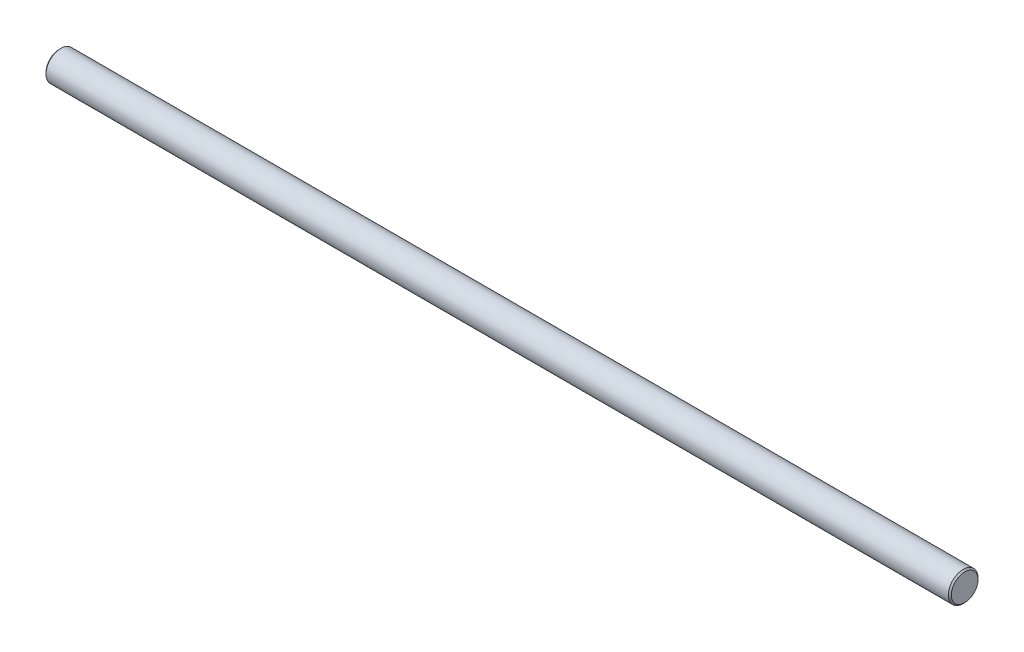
ISO-10303-21;
HEADER;
FILE_DESCRIPTION(('STEP AP214'),'2;1');
FILE_NAME('part.step','',(''),(''),'','','');
FILE_SCHEMA(('AUTOMOTIVE_DESIGN { 1 0 10303 214 1 1 1 1 }'));
ENDSEC;
DATA;
#1=APPLICATION_CONTEXT('core data for automotive mechanical design processes');
#2=APPLICATION_PROTOCOL_DEFINITION('international standard','automotive_design',2000,#1);
#3=PRODUCT_CONTEXT('',#1,'mechanical');
#4=PRODUCT('Part','Part','',(#3));
#5=PRODUCT_RELATED_PRODUCT_CATEGORY('part','',(#4));
#6=PRODUCT_DEFINITION_FORMATION('','',#4);
#7=PRODUCT_DEFINITION_CONTEXT('part definition',#1,'design');
#8=PRODUCT_DEFINITION('design','',#6,#7);
#9=PRODUCT_DEFINITION_SHAPE('','',#8);
#10=(LENGTH_UNIT() NAMED_UNIT(*) SI_UNIT(.MILLI.,.METRE.));
#11=(NAMED_UNIT(*) PLANE_ANGLE_UNIT() SI_UNIT($,.RADIAN.));
#12=(NAMED_UNIT(*) SI_UNIT($,.STERADIAN.) SOLID_ANGLE_UNIT());
#13=UNCERTAINTY_MEASURE_WITH_UNIT(LENGTH_MEASURE(1.E-05),#10,'distance_accuracy_value','');
#14=(GEOMETRIC_REPRESENTATION_CONTEXT(3) GLOBAL_UNCERTAINTY_ASSIGNED_CONTEXT((#13)) GLOBAL_UNIT_ASSIGNED_CONTEXT((#10,
#11,#12)) REPRESENTATION_CONTEXT('',''));
#15=CARTESIAN_POINT('',(0.,0.,0.));
#16=DIRECTION('',(0.,0.,1.));
#17=DIRECTION('',(1.,0.,0.));
#18=AXIS2_PLACEMENT_3D('',#15,#16,#17);
#19=CARTESIAN_POINT('',(305.,0.,0.));
#20=DIRECTION('',(1.,0.,0.));
#21=DIRECTION('',(0.,0.,-1.));
#22=AXIS2_PLACEMENT_3D('',#19,#20,#21);
#23=PLANE('',#22);
#24=CARTESIAN_POINT('',(305.000000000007,0.,0.));
#25=DIRECTION('',(-1.,0.,0.));
#26=DIRECTION('',(0.,0.,1.));
#27=AXIS2_PLACEMENT_3D('',#24,#25,#26);
#28=CIRCLE('',#27,4.50000000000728);
#29=CARTESIAN_POINT('',(305.000000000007,0.,4.50000000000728));
#30=VERTEX_POINT('',#29);
#31=EDGE_CURVE('E18',#30,#30,#28,.T.);
#32=ORIENTED_EDGE('',*,*,#31,.F.);
#33=EDGE_LOOP('',(#32));
#34=FACE_BOUND('',#33,.T.);
#35=ADVANCED_FACE('F15',(#34),#23,.T.);
#36=CARTESIAN_POINT('',(0.,0.,0.));
#37=DIRECTION('',(1.,0.,0.));
#38=DIRECTION('',(0.,0.,-1.));
#39=AXIS2_PLACEMENT_3D('',#36,#37,#38);
#40=PLANE('',#39);
#41=CARTESIAN_POINT('',(0.,0.,0.));
#42=DIRECTION('',(1.,0.,0.));
#43=DIRECTION('',(0.,0.,-1.));
#44=AXIS2_PLACEMENT_3D('',#41,#42,#43);
#45=CIRCLE('',#44,4.50000000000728);
#46=CARTESIAN_POINT('',(0.,0.,-4.50000000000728));
#47=VERTEX_POINT('',#46);
#48=EDGE_CURVE('E27',#47,#47,#45,.T.);
#49=ORIENTED_EDGE('',*,*,#48,.F.);
#50=EDGE_LOOP('',(#49));
#51=FACE_BOUND('',#50,.T.);
#52=ADVANCED_FACE('F38',(#51),#40,.F.);
#53=CARTESIAN_POINT('',(304.500000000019,0.,0.));
#54=DIRECTION('',(-1.,0.,0.));
#55=DIRECTION('',(0.,0.,1.));
#56=AXIS2_PLACEMENT_3D('',#53,#54,#55);
#57=CONICAL_SURFACE('',#56,4.99999999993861,0.785398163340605);
#58=CARTESIAN_POINT('',(304.5,0.,0.));
#59=DIRECTION('',(-1.,0.,0.));
#60=DIRECTION('',(0.,0.,1.));
#61=AXIS2_PLACEMENT_3D('',#58,#59,#60);
#62=CIRCLE('',#61,5.);
#63=CARTESIAN_POINT('',(304.5,0.,5.));
#64=VERTEX_POINT('',#63);
#65=EDGE_CURVE('E22',#64,#64,#62,.T.);
#66=ORIENTED_EDGE('',*,*,#65,.F.);
#67=EDGE_LOOP('',(#66));
#68=FACE_BOUND('',#67,.T.);
#69=ORIENTED_EDGE('',*,*,#31,.T.);
#70=EDGE_LOOP('',(#69));
#71=FACE_BOUND('',#70,.T.);
#72=ADVANCED_FACE('F35',(#68,#71),#57,.T.);
#73=CARTESIAN_POINT('',(0.499999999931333,0.,0.));
#74=DIRECTION('',(1.,0.,0.));
#75=DIRECTION('',(0.,0.,-1.));
#76=AXIS2_PLACEMENT_3D('',#73,#74,#75);
#77=CONICAL_SURFACE('',#76,4.99999999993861,0.785398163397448);
#78=CARTESIAN_POINT('',(0.5,0.,0.));
#79=DIRECTION('',(-1.,0.,0.));
#80=DIRECTION('',(0.,0.,1.));
#81=AXIS2_PLACEMENT_3D('',#78,#79,#80);
#82=CIRCLE('',#81,5.);
#83=CARTESIAN_POINT('',(0.5,0.,5.));
#84=VERTEX_POINT('',#83);
#85=EDGE_CURVE('E10',#84,#84,#82,.F.);
#86=ORIENTED_EDGE('',*,*,#85,.F.);
#87=EDGE_LOOP('',(#86));
#88=FACE_BOUND('',#87,.T.);
#89=ORIENTED_EDGE('',*,*,#48,.T.);
#90=EDGE_LOOP('',(#89));
#91=FACE_BOUND('',#90,.T.);
#92=ADVANCED_FACE('F46',(#88,#91),#77,.T.);
#93=CARTESIAN_POINT('',(305.,0.,0.));
#94=DIRECTION('',(-1.,0.,0.));
#95=DIRECTION('',(0.,0.,1.));
#96=AXIS2_PLACEMENT_3D('',#93,#94,#95);
#97=CYLINDRICAL_SURFACE('',#96,5.);
#98=ORIENTED_EDGE('',*,*,#85,.T.);
#99=EDGE_LOOP('',(#98));
#100=FACE_BOUND('',#99,.T.);
#101=ORIENTED_EDGE('',*,*,#65,.T.);
#102=EDGE_LOOP('',(#101));
#103=FACE_BOUND('',#102,.T.);
#104=ADVANCED_FACE('F44',(#100,#103),#97,.T.);
#105=CLOSED_SHELL('',(#35,#52,#72,#92,#104));
#106=MANIFOLD_SOLID_BREP('B1',#105);
#107=ADVANCED_BREP_SHAPE_REPRESENTATION('',(#18,#106),#14);
#108=SHAPE_DEFINITION_REPRESENTATION(#9,#107);
ENDSEC;
END-ISO-10303-21;
